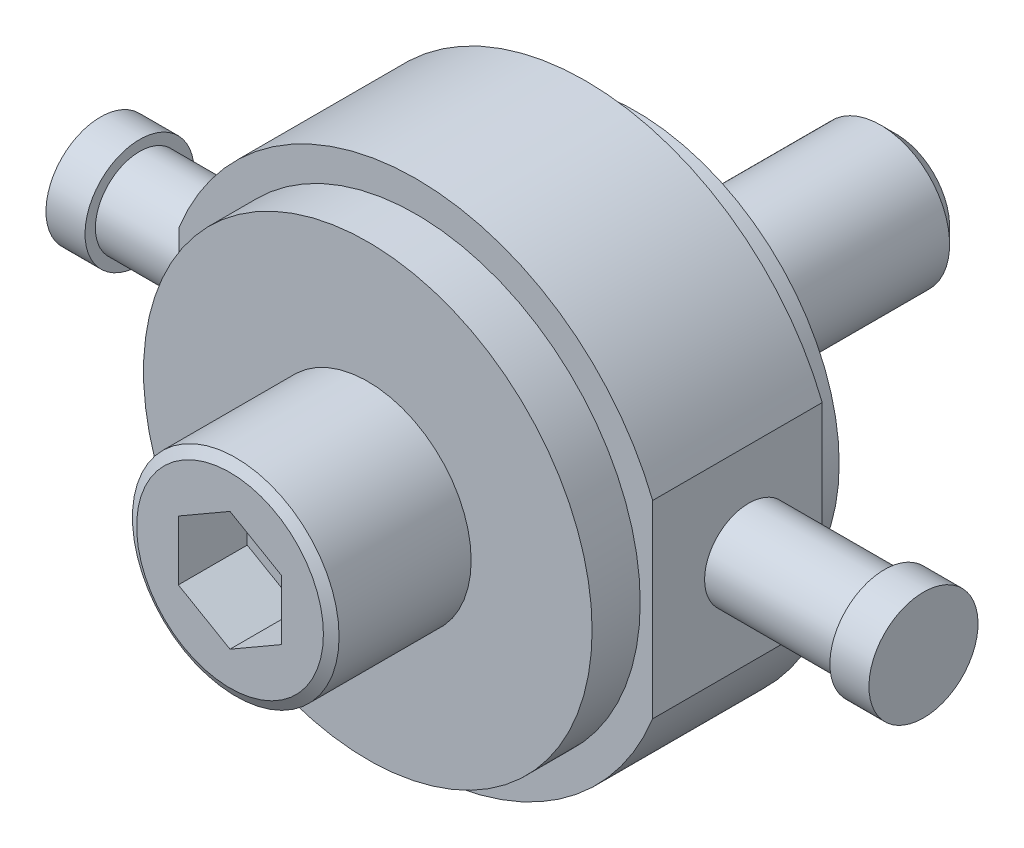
ISO-10303-21;
HEADER;
FILE_DESCRIPTION(('STEP AP214'),'2;1');
FILE_NAME('part.step','',(''),(''),'','','');
FILE_SCHEMA(('AUTOMOTIVE_DESIGN { 1 0 10303 214 1 1 1 1 }'));
ENDSEC;
DATA;
#1=APPLICATION_CONTEXT('core data for automotive mechanical design processes');
#2=APPLICATION_PROTOCOL_DEFINITION('international standard','automotive_design',2000,#1);
#3=PRODUCT_CONTEXT('',#1,'mechanical');
#4=PRODUCT('Part','Part','',(#3));
#5=PRODUCT_RELATED_PRODUCT_CATEGORY('part','',(#4));
#6=PRODUCT_DEFINITION_FORMATION('','',#4);
#7=PRODUCT_DEFINITION_CONTEXT('part definition',#1,'design');
#8=PRODUCT_DEFINITION('design','',#6,#7);
#9=PRODUCT_DEFINITION_SHAPE('','',#8);
#10=(LENGTH_UNIT() NAMED_UNIT(*) SI_UNIT(.MILLI.,.METRE.));
#11=(NAMED_UNIT(*) PLANE_ANGLE_UNIT() SI_UNIT($,.RADIAN.));
#12=(NAMED_UNIT(*) SI_UNIT($,.STERADIAN.) SOLID_ANGLE_UNIT());
#13=UNCERTAINTY_MEASURE_WITH_UNIT(LENGTH_MEASURE(1.E-05),#10,'distance_accuracy_value','');
#14=(GEOMETRIC_REPRESENTATION_CONTEXT(3) GLOBAL_UNCERTAINTY_ASSIGNED_CONTEXT((#13)) GLOBAL_UNIT_ASSIGNED_CONTEXT((#10,
#11,#12)) REPRESENTATION_CONTEXT('',''));
#15=CARTESIAN_POINT('',(0.,0.,0.));
#16=DIRECTION('',(0.,0.,1.));
#17=DIRECTION('',(1.,0.,0.));
#18=AXIS2_PLACEMENT_3D('',#15,#16,#17);
#19=CARTESIAN_POINT('',(0.,0.,0.));
#20=DIRECTION('',(0.,0.,1.));
#21=DIRECTION('',(1.,0.,0.));
#22=AXIS2_PLACEMENT_3D('',#19,#20,#21);
#23=PLANE('',#22);
#24=CARTESIAN_POINT('',(0.,0.,0.));
#25=DIRECTION('',(0.,0.,1.));
#26=DIRECTION('',(1.,0.,0.));
#27=AXIS2_PLACEMENT_3D('',#24,#25,#26);
#28=CIRCLE('',#27,53.15);
#29=CARTESIAN_POINT('',(53.15,0.,0.));
#30=VERTEX_POINT('',#29);
#31=EDGE_CURVE('E184',#30,#30,#28,.T.);
#32=ORIENTED_EDGE('',*,*,#31,.F.);
#33=EDGE_LOOP('',(#32));
#34=FACE_BOUND('',#33,.T.);
#35=CARTESIAN_POINT('',(0.,0.,0.));
#36=DIRECTION('',(0.,0.,-1.));
#37=DIRECTION('',(-1.,0.,0.));
#38=AXIS2_PLACEMENT_3D('',#35,#36,#37);
#39=CIRCLE('',#38,18.);
#40=CARTESIAN_POINT('',(-18.,0.,0.));
#41=VERTEX_POINT('',#40);
#42=EDGE_CURVE('E150',#41,#41,#39,.T.);
#43=ORIENTED_EDGE('',*,*,#42,.F.);
#44=EDGE_LOOP('',(#43));
#45=FACE_BOUND('',#44,.T.);
#46=ADVANCED_FACE('F14',(#34,#45),#23,.F.);
#47=CARTESIAN_POINT('',(97.3,0.,32.33));
#48=DIRECTION('',(-1.,0.,0.));
#49=DIRECTION('',(0.,-1.,0.));
#50=AXIS2_PLACEMENT_3D('',#47,#48,#49);
#51=PLANE('',#50);
#52=CARTESIAN_POINT('',(97.3,0.,32.33));
#53=DIRECTION('',(-1.,0.,0.));
#54=DIRECTION('',(0.,0.,1.));
#55=AXIS2_PLACEMENT_3D('',#52,#53,#54);
#56=CIRCLE('',#55,11.5325);
#57=CARTESIAN_POINT('',(97.3,0.,43.8625));
#58=VERTEX_POINT('',#57);
#59=EDGE_CURVE('E181',#58,#58,#56,.T.);
#60=ORIENTED_EDGE('',*,*,#59,.F.);
#61=EDGE_LOOP('',(#60));
#62=FACE_BOUND('',#61,.T.);
#63=CARTESIAN_POINT('',(97.3,0.,32.33));
#64=DIRECTION('',(-1.,0.,0.));
#65=DIRECTION('',(0.,-1.,0.));
#66=AXIS2_PLACEMENT_3D('',#63,#64,#65);
#67=CIRCLE('',#66,14.25);
#68=CARTESIAN_POINT('',(97.3,-14.25,32.33));
#69=VERTEX_POINT('',#68);
#70=EDGE_CURVE('E24',#69,#69,#67,.T.);
#71=ORIENTED_EDGE('',*,*,#70,.T.);
#72=EDGE_LOOP('',(#71));
#73=FACE_BOUND('',#72,.T.);
#74=ADVANCED_FACE('F241',(#62,#73),#51,.T.);
#75=CARTESIAN_POINT('',(-97.3,0.,32.33));
#76=DIRECTION('',(-1.,0.,0.));
#77=DIRECTION('',(0.,-1.,0.));
#78=AXIS2_PLACEMENT_3D('',#75,#76,#77);
#79=PLANE('',#78);
#80=CARTESIAN_POINT('',(-97.3,0.,32.33));
#81=DIRECTION('',(-1.,0.,0.));
#82=DIRECTION('',(0.,0.,1.));
#83=AXIS2_PLACEMENT_3D('',#80,#81,#82);
#84=CIRCLE('',#83,11.5325);
#85=CARTESIAN_POINT('',(-97.3,0.,43.8625));
#86=VERTEX_POINT('',#85);
#87=EDGE_CURVE('E173',#86,#86,#84,.F.);
#88=ORIENTED_EDGE('',*,*,#87,.F.);
#89=EDGE_LOOP('',(#88));
#90=FACE_BOUND('',#89,.T.);
#91=CARTESIAN_POINT('',(-97.3,0.,32.33));
#92=DIRECTION('',(-1.,0.,0.));
#93=DIRECTION('',(0.,-1.,0.));
#94=AXIS2_PLACEMENT_3D('',#91,#92,#93);
#95=CIRCLE('',#94,14.25);
#96=CARTESIAN_POINT('',(-97.3,-14.25,32.33));
#97=VERTEX_POINT('',#96);
#98=EDGE_CURVE('E155',#97,#97,#95,.T.);
#99=ORIENTED_EDGE('',*,*,#98,.F.);
#100=EDGE_LOOP('',(#99));
#101=FACE_BOUND('',#100,.T.);
#102=ADVANCED_FACE('F247',(#90,#101),#79,.F.);
#103=CARTESIAN_POINT('',(-103.85,0.,32.33));
#104=DIRECTION('',(1.,0.,0.));
#105=DIRECTION('',(0.,0.,-1.));
#106=AXIS2_PLACEMENT_3D('',#103,#104,#105);
#107=CYLINDRICAL_SURFACE('',#106,11.5325);
#108=CARTESIAN_POINT('',(-61.85,0.,32.33));
#109=DIRECTION('',(1.,0.,0.));
#110=DIRECTION('',(0.,0.,-1.));
#111=AXIS2_PLACEMENT_3D('',#108,#109,#110);
#112=CIRCLE('',#111,11.5325);
#113=CARTESIAN_POINT('',(-61.85,0.,20.7975));
#114=VERTEX_POINT('',#113);
#115=EDGE_CURVE('E174',#114,#114,#112,.T.);
#116=ORIENTED_EDGE('',*,*,#115,.F.);
#117=EDGE_LOOP('',(#116));
#118=FACE_BOUND('',#117,.T.);
#119=ORIENTED_EDGE('',*,*,#87,.T.);
#120=EDGE_LOOP('',(#119));
#121=FACE_BOUND('',#120,.T.);
#122=ADVANCED_FACE('F332',(#118,#121),#107,.T.);
#123=CARTESIAN_POINT('',(0.,0.,70.));
#124=DIRECTION('',(0.,0.,1.));
#125=DIRECTION('',(1.,0.,0.));
#126=AXIS2_PLACEMENT_3D('',#123,#124,#125);
#127=PLANE('',#126);
#128=CARTESIAN_POINT('',(0.,0.,70.));
#129=DIRECTION('',(0.,0.,1.));
#130=DIRECTION('',(1.,0.,0.));
#131=AXIS2_PLACEMENT_3D('',#128,#129,#130);
#132=CIRCLE('',#131,58.6);
#133=CARTESIAN_POINT('',(58.6,0.,70.));
#134=VERTEX_POINT('',#133);
#135=EDGE_CURVE('E169',#134,#134,#132,.T.);
#136=ORIENTED_EDGE('',*,*,#135,.T.);
#137=EDGE_LOOP('',(#136));
#138=FACE_BOUND('',#137,.T.);
#139=CARTESIAN_POINT('',(0.,0.,70.));
#140=DIRECTION('',(0.,0.,1.));
#141=DIRECTION('',(1.,0.,0.));
#142=AXIS2_PLACEMENT_3D('',#139,#140,#141);
#143=CIRCLE('',#142,27.);
#144=CARTESIAN_POINT('',(27.,0.,70.));
#145=VERTEX_POINT('',#144);
#146=EDGE_CURVE('E161',#145,#145,#143,.T.);
#147=ORIENTED_EDGE('',*,*,#146,.F.);
#148=EDGE_LOOP('',(#147));
#149=FACE_BOUND('',#148,.T.);
#150=ADVANCED_FACE('F291',(#138,#149),#127,.T.);
#151=CARTESIAN_POINT('',(0.,0.,57.43));
#152=DIRECTION('',(0.,0.,1.));
#153=DIRECTION('',(1.,0.,0.));
#154=AXIS2_PLACEMENT_3D('',#151,#152,#153);
#155=PLANE('',#154);
#156=CARTESIAN_POINT('',(0.,0.,57.43));
#157=DIRECTION('',(0.,0.,1.));
#158=DIRECTION('',(1.,0.,0.));
#159=AXIS2_PLACEMENT_3D('',#156,#157,#158);
#160=CIRCLE('',#159,66.6);
#161=CARTESIAN_POINT('',(-61.85,-24.7009615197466,57.43));
#162=VERTEX_POINT('',#161);
#163=CARTESIAN_POINT('',(61.85,-24.7009615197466,57.43));
#164=VERTEX_POINT('',#163);
#165=EDGE_CURVE('E172',#162,#164,#160,.T.);
#166=ORIENTED_EDGE('',*,*,#165,.T.);
#167=DIRECTION('',(0.,-1.,0.));
#168=VECTOR('',#167,1.);
#169=CARTESIAN_POINT('',(61.85,24.7009615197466,57.43));
#170=LINE('',#169,#168);
#171=CARTESIAN_POINT('',(61.85,24.7009615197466,57.43));
#172=VERTEX_POINT('',#171);
#173=EDGE_CURVE('E199',#172,#164,#170,.T.);
#174=ORIENTED_EDGE('',*,*,#173,.F.);
#175=CARTESIAN_POINT('',(0.,0.,57.43));
#176=DIRECTION('',(0.,0.,1.));
#177=DIRECTION('',(1.,0.,0.));
#178=AXIS2_PLACEMENT_3D('',#175,#176,#177);
#179=CIRCLE('',#178,66.6);
#180=CARTESIAN_POINT('',(-61.85,24.7009615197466,57.43));
#181=VERTEX_POINT('',#180);
#182=EDGE_CURVE('E200',#172,#181,#179,.T.);
#183=ORIENTED_EDGE('',*,*,#182,.T.);
#184=DIRECTION('',(0.,-1.,0.));
#185=VECTOR('',#184,1.);
#186=CARTESIAN_POINT('',(-61.85,24.7009615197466,57.43));
#187=LINE('',#186,#185);
#188=EDGE_CURVE('E196',#181,#162,#187,.T.);
#189=ORIENTED_EDGE('',*,*,#188,.T.);
#190=EDGE_LOOP('',(#166,#174,#183,#189));
#191=FACE_BOUND('',#190,.T.);
#192=CARTESIAN_POINT('',(0.,0.,57.43));
#193=DIRECTION('',(0.,0.,1.));
#194=DIRECTION('',(1.,0.,0.));
#195=AXIS2_PLACEMENT_3D('',#192,#193,#194);
#196=CIRCLE('',#195,58.6);
#197=CARTESIAN_POINT('',(58.6,0.,57.43));
#198=VERTEX_POINT('',#197);
#199=EDGE_CURVE('E165',#198,#198,#196,.T.);
#200=ORIENTED_EDGE('',*,*,#199,.F.);
#201=EDGE_LOOP('',(#200));
#202=FACE_BOUND('',#201,.T.);
#203=ADVANCED_FACE('F285',(#191,#202),#155,.T.);
#204=CARTESIAN_POINT('',(61.85,24.7009615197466,57.43));
#205=DIRECTION('',(1.,0.,0.));
#206=DIRECTION('',(0.,0.,-1.));
#207=AXIS2_PLACEMENT_3D('',#204,#205,#206);
#208=PLANE('',#207);
#209=DIRECTION('',(0.,0.,-1.));
#210=VECTOR('',#209,1.);
#211=CARTESIAN_POINT('',(61.85,24.7009615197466,57.43));
#212=LINE('',#211,#210);
#213=CARTESIAN_POINT('',(61.85,24.7009615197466,13.13));
#214=VERTEX_POINT('',#213);
#215=EDGE_CURVE('E187',#172,#214,#212,.T.);
#216=ORIENTED_EDGE('',*,*,#215,.F.);
#217=ORIENTED_EDGE('',*,*,#173,.T.);
#218=DIRECTION('',(0.,0.,-1.));
#219=VECTOR('',#218,1.);
#220=CARTESIAN_POINT('',(61.85,-24.7009615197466,57.43));
#221=LINE('',#220,#219);
#222=CARTESIAN_POINT('',(61.85,-24.7009615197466,13.13));
#223=VERTEX_POINT('',#222);
#224=EDGE_CURVE('E192',#164,#223,#221,.T.);
#225=ORIENTED_EDGE('',*,*,#224,.T.);
#226=DIRECTION('',(0.,-1.,0.));
#227=VECTOR('',#226,1.);
#228=CARTESIAN_POINT('',(61.85,24.7009615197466,13.13));
#229=LINE('',#228,#227);
#230=EDGE_CURVE('E188',#214,#223,#229,.T.);
#231=ORIENTED_EDGE('',*,*,#230,.F.);
#232=EDGE_LOOP('',(#216,#217,#225,#231));
#233=FACE_BOUND('',#232,.T.);
#234=CARTESIAN_POINT('',(61.85,0.,32.33));
#235=DIRECTION('',(1.,0.,0.));
#236=DIRECTION('',(0.,0.,-1.));
#237=AXIS2_PLACEMENT_3D('',#234,#235,#236);
#238=CIRCLE('',#237,11.5325);
#239=CARTESIAN_POINT('',(61.85,0.,20.7975));
#240=VERTEX_POINT('',#239);
#241=EDGE_CURVE('E168',#240,#240,#238,.T.);
#242=ORIENTED_EDGE('',*,*,#241,.F.);
#243=EDGE_LOOP('',(#242));
#244=FACE_BOUND('',#243,.T.);
#245=ADVANCED_FACE('F254',(#233,#244),#208,.T.);
#246=CARTESIAN_POINT('',(0.,0.,13.13));
#247=DIRECTION('',(0.,0.,1.));
#248=DIRECTION('',(1.,0.,0.));
#249=AXIS2_PLACEMENT_3D('',#246,#247,#248);
#250=PLANE('',#249);
#251=CARTESIAN_POINT('',(0.,0.,13.13));
#252=DIRECTION('',(0.,0.,1.));
#253=DIRECTION('',(1.,0.,0.));
#254=AXIS2_PLACEMENT_3D('',#251,#252,#253);
#255=CIRCLE('',#254,66.6);
#256=CARTESIAN_POINT('',(-61.85,-24.7009615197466,13.13));
#257=VERTEX_POINT('',#256);
#258=EDGE_CURVE('E193',#257,#223,#255,.T.);
#259=ORIENTED_EDGE('',*,*,#258,.F.);
#260=DIRECTION('',(0.,-1.,0.));
#261=VECTOR('',#260,1.);
#262=CARTESIAN_POINT('',(-61.85,24.7009615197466,13.13));
#263=LINE('',#262,#261);
#264=CARTESIAN_POINT('',(-61.85,24.7009615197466,13.13));
#265=VERTEX_POINT('',#264);
#266=EDGE_CURVE('E182',#265,#257,#263,.T.);
#267=ORIENTED_EDGE('',*,*,#266,.F.);
#268=CARTESIAN_POINT('',(0.,0.,13.13));
#269=DIRECTION('',(0.,0.,1.));
#270=DIRECTION('',(1.,0.,0.));
#271=AXIS2_PLACEMENT_3D('',#268,#269,#270);
#272=CIRCLE('',#271,66.6);
#273=EDGE_CURVE('E178',#214,#265,#272,.T.);
#274=ORIENTED_EDGE('',*,*,#273,.F.);
#275=ORIENTED_EDGE('',*,*,#230,.T.);
#276=EDGE_LOOP('',(#259,#267,#274,#275));
#277=FACE_BOUND('',#276,.T.);
#278=CARTESIAN_POINT('',(0.,0.,13.13));
#279=DIRECTION('',(0.,0.,1.));
#280=DIRECTION('',(1.,0.,0.));
#281=AXIS2_PLACEMENT_3D('',#278,#279,#280);
#282=CIRCLE('',#281,53.15);
#283=CARTESIAN_POINT('',(53.15,0.,13.13));
#284=VERTEX_POINT('',#283);
#285=EDGE_CURVE('E191',#284,#284,#282,.T.);
#286=ORIENTED_EDGE('',*,*,#285,.T.);
#287=EDGE_LOOP('',(#286));
#288=FACE_BOUND('',#287,.T.);
#289=ADVANCED_FACE('F274',(#277,#288),#250,.F.);
#290=CARTESIAN_POINT('',(0.,0.,57.43));
#291=DIRECTION('',(0.,0.,-1.));
#292=DIRECTION('',(-1.,0.,0.));
#293=AXIS2_PLACEMENT_3D('',#290,#291,#292);
#294=CYLINDRICAL_SURFACE('',#293,66.6);
#295=ORIENTED_EDGE('',*,*,#224,.F.);
#296=ORIENTED_EDGE('',*,*,#165,.F.);
#297=DIRECTION('',(0.,0.,-1.));
#298=VECTOR('',#297,1.);
#299=CARTESIAN_POINT('',(-61.85,-24.7009615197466,57.43));
#300=LINE('',#299,#298);
#301=EDGE_CURVE('E88',#162,#257,#300,.T.);
#302=ORIENTED_EDGE('',*,*,#301,.T.);
#303=ORIENTED_EDGE('',*,*,#258,.T.);
#304=EDGE_LOOP('',(#295,#296,#302,#303));
#305=FACE_BOUND('',#304,.T.);
#306=ADVANCED_FACE('F276',(#305),#294,.T.);
#307=CARTESIAN_POINT('',(0.,0.,57.43));
#308=DIRECTION('',(0.,0.,-1.));
#309=DIRECTION('',(-1.,0.,0.));
#310=AXIS2_PLACEMENT_3D('',#307,#308,#309);
#311=CYLINDRICAL_SURFACE('',#310,66.6);
#312=DIRECTION('',(0.,0.,-1.));
#313=VECTOR('',#312,1.);
#314=CARTESIAN_POINT('',(-61.85,24.7009615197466,57.43));
#315=LINE('',#314,#313);
#316=EDGE_CURVE('E177',#181,#265,#315,.T.);
#317=ORIENTED_EDGE('',*,*,#316,.F.);
#318=ORIENTED_EDGE('',*,*,#182,.F.);
#319=ORIENTED_EDGE('',*,*,#215,.T.);
#320=ORIENTED_EDGE('',*,*,#273,.T.);
#321=EDGE_LOOP('',(#317,#318,#319,#320));
#322=FACE_BOUND('',#321,.T.);
#323=ADVANCED_FACE('F268',(#322),#311,.T.);
#324=CARTESIAN_POINT('',(-61.85,24.7009615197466,57.43));
#325=DIRECTION('',(1.,0.,0.));
#326=DIRECTION('',(0.,0.,-1.));
#327=AXIS2_PLACEMENT_3D('',#324,#325,#326);
#328=PLANE('',#327);
#329=ORIENTED_EDGE('',*,*,#115,.T.);
#330=EDGE_LOOP('',(#329));
#331=FACE_BOUND('',#330,.T.);
#332=ORIENTED_EDGE('',*,*,#188,.F.);
#333=ORIENTED_EDGE('',*,*,#316,.T.);
#334=ORIENTED_EDGE('',*,*,#266,.T.);
#335=ORIENTED_EDGE('',*,*,#301,.F.);
#336=EDGE_LOOP('',(#332,#333,#334,#335));
#337=FACE_BOUND('',#336,.T.);
#338=ADVANCED_FACE('F259',(#331,#337),#328,.F.);
#339=CARTESIAN_POINT('',(0.,0.,13.13));
#340=DIRECTION('',(0.,0.,-1.));
#341=DIRECTION('',(-1.,0.,0.));
#342=AXIS2_PLACEMENT_3D('',#339,#340,#341);
#343=CYLINDRICAL_SURFACE('',#342,53.15);
#344=ORIENTED_EDGE('',*,*,#285,.F.);
#345=EDGE_LOOP('',(#344));
#346=FACE_BOUND('',#345,.T.);
#347=ORIENTED_EDGE('',*,*,#31,.T.);
#348=EDGE_LOOP('',(#347));
#349=FACE_BOUND('',#348,.T.);
#350=ADVANCED_FACE('F256',(#346,#349),#343,.T.);
#351=CARTESIAN_POINT('',(103.85,0.,32.33));
#352=DIRECTION('',(-1.,0.,0.));
#353=DIRECTION('',(0.,0.,1.));
#354=AXIS2_PLACEMENT_3D('',#351,#352,#353);
#355=CYLINDRICAL_SURFACE('',#354,11.5325);
#356=ORIENTED_EDGE('',*,*,#59,.T.);
#357=EDGE_LOOP('',(#356));
#358=FACE_BOUND('',#357,.T.);
#359=ORIENTED_EDGE('',*,*,#241,.T.);
#360=EDGE_LOOP('',(#359));
#361=FACE_BOUND('',#360,.T.);
#362=ADVANCED_FACE('F258',(#358,#361),#355,.T.);
#363=CARTESIAN_POINT('',(0.,0.,70.));
#364=DIRECTION('',(0.,0.,-1.));
#365=DIRECTION('',(-1.,0.,0.));
#366=AXIS2_PLACEMENT_3D('',#363,#364,#365);
#367=CYLINDRICAL_SURFACE('',#366,58.6);
#368=ORIENTED_EDGE('',*,*,#135,.F.);
#369=EDGE_LOOP('',(#368));
#370=FACE_BOUND('',#369,.T.);
#371=ORIENTED_EDGE('',*,*,#199,.T.);
#372=EDGE_LOOP('',(#371));
#373=FACE_BOUND('',#372,.T.);
#374=ADVANCED_FACE('F265',(#370,#373),#367,.T.);
#375=CARTESIAN_POINT('',(0.,0.,106.));
#376=DIRECTION('',(0.,0.,-1.));
#377=DIRECTION('',(-1.,0.,0.));
#378=AXIS2_PLACEMENT_3D('',#375,#376,#377);
#379=CYLINDRICAL_SURFACE('',#378,27.);
#380=CARTESIAN_POINT('',(0.,0.,104.5));
#381=DIRECTION('',(0.,0.,1.));
#382=DIRECTION('',(1.,0.,0.));
#383=AXIS2_PLACEMENT_3D('',#380,#381,#382);
#384=CIRCLE('',#383,27.);
#385=CARTESIAN_POINT('',(27.,0.,104.5));
#386=VERTEX_POINT('',#385);
#387=EDGE_CURVE('E18',#386,#386,#384,.F.);
#388=ORIENTED_EDGE('',*,*,#387,.T.);
#389=EDGE_LOOP('',(#388));
#390=FACE_BOUND('',#389,.T.);
#391=ORIENTED_EDGE('',*,*,#146,.T.);
#392=EDGE_LOOP('',(#391));
#393=FACE_BOUND('',#392,.T.);
#394=ADVANCED_FACE('F309',(#390,#393),#379,.T.);
#395=CARTESIAN_POINT('',(0.,0.,106.));
#396=DIRECTION('',(0.,0.,1.));
#397=DIRECTION('',(1.,0.,0.));
#398=AXIS2_PLACEMENT_3D('',#395,#396,#397);
#399=PLANE('',#398);
#400=DIRECTION('',(-0.866025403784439,0.5,0.));
#401=VECTOR('',#400,1.);
#402=CARTESIAN_POINT('',(13.5,7.79422863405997,106.));
#403=LINE('',#402,#401);
#404=CARTESIAN_POINT('',(13.5,7.79422863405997,106.));
#405=VERTEX_POINT('',#404);
#406=CARTESIAN_POINT('',(0.,15.5884572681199,106.));
#407=VERTEX_POINT('',#406);
#408=EDGE_CURVE('E94',#405,#407,#403,.T.);
#409=ORIENTED_EDGE('',*,*,#408,.F.);
#410=DIRECTION('',(0.,1.,0.));
#411=VECTOR('',#410,1.);
#412=CARTESIAN_POINT('',(13.5,-7.79422863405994,106.));
#413=LINE('',#412,#411);
#414=CARTESIAN_POINT('',(13.5,-7.79422863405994,106.));
#415=VERTEX_POINT('',#414);
#416=EDGE_CURVE('E142',#415,#405,#413,.T.);
#417=ORIENTED_EDGE('',*,*,#416,.F.);
#418=DIRECTION('',(0.866025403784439,0.5,0.));
#419=VECTOR('',#418,1.);
#420=CARTESIAN_POINT('',(0.,-15.5884572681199,106.));
#421=LINE('',#420,#419);
#422=CARTESIAN_POINT('',(0.,-15.5884572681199,106.));
#423=VERTEX_POINT('',#422);
#424=EDGE_CURVE('E138',#423,#415,#421,.T.);
#425=ORIENTED_EDGE('',*,*,#424,.F.);
#426=DIRECTION('',(0.866025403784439,-0.5,0.));
#427=VECTOR('',#426,1.);
#428=CARTESIAN_POINT('',(-13.5,-7.79422863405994,106.));
#429=LINE('',#428,#427);
#430=CARTESIAN_POINT('',(-13.5,-7.79422863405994,106.));
#431=VERTEX_POINT('',#430);
#432=EDGE_CURVE('E134',#431,#423,#429,.T.);
#433=ORIENTED_EDGE('',*,*,#432,.F.);
#434=DIRECTION('',(0.,-1.,0.));
#435=VECTOR('',#434,1.);
#436=CARTESIAN_POINT('',(-13.5,7.79422863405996,106.));
#437=LINE('',#436,#435);
#438=CARTESIAN_POINT('',(-13.5,7.79422863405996,106.));
#439=VERTEX_POINT('',#438);
#440=EDGE_CURVE('E130',#439,#431,#437,.T.);
#441=ORIENTED_EDGE('',*,*,#440,.F.);
#442=DIRECTION('',(-0.866025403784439,-0.5,0.));
#443=VECTOR('',#442,1.);
#444=CARTESIAN_POINT('',(0.,15.5884572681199,106.));
#445=LINE('',#444,#443);
#446=EDGE_CURVE('E103',#407,#439,#445,.T.);
#447=ORIENTED_EDGE('',*,*,#446,.F.);
#448=EDGE_LOOP('',(#409,#417,#425,#433,#441,#447));
#449=FACE_BOUND('',#448,.T.);
#450=CARTESIAN_POINT('',(0.,0.,106.));
#451=DIRECTION('',(0.,0.,1.));
#452=DIRECTION('',(1.,0.,0.));
#453=AXIS2_PLACEMENT_3D('',#450,#451,#452);
#454=CIRCLE('',#453,24.4019237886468);
#455=CARTESIAN_POINT('',(24.4019237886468,0.,106.));
#456=VERTEX_POINT('',#455);
#457=EDGE_CURVE('E164',#456,#456,#454,.T.);
#458=ORIENTED_EDGE('',*,*,#457,.T.);
#459=EDGE_LOOP('',(#458));
#460=FACE_BOUND('',#459,.T.);
#461=ADVANCED_FACE('F225',(#449,#460),#399,.T.);
#462=CARTESIAN_POINT('',(0.,0.,-63.5));
#463=DIRECTION('',(0.,0.,1.));
#464=DIRECTION('',(1.,0.,0.));
#465=AXIS2_PLACEMENT_3D('',#462,#463,#464);
#466=CYLINDRICAL_SURFACE('',#465,18.);
#467=CARTESIAN_POINT('',(0.,0.,-64.));
#468=DIRECTION('',(0.,0.,-1.));
#469=DIRECTION('',(-1.,0.,0.));
#470=AXIS2_PLACEMENT_3D('',#467,#468,#469);
#471=CIRCLE('',#470,18.);
#472=CARTESIAN_POINT('',(-18.,0.,-64.));
#473=VERTEX_POINT('',#472);
#474=EDGE_CURVE('E153',#473,#473,#471,.F.);
#475=ORIENTED_EDGE('',*,*,#474,.T.);
#476=EDGE_LOOP('',(#475));
#477=FACE_BOUND('',#476,.T.);
#478=ORIENTED_EDGE('',*,*,#42,.T.);
#479=EDGE_LOOP('',(#478));
#480=FACE_BOUND('',#479,.T.);
#481=ADVANCED_FACE('F317',(#477,#480),#466,.T.);
#482=CARTESIAN_POINT('',(0.,0.,-68.));
#483=DIRECTION('',(0.,0.,-1.));
#484=DIRECTION('',(-1.,0.,0.));
#485=AXIS2_PLACEMENT_3D('',#482,#483,#484);
#486=PLANE('',#485);
#487=CARTESIAN_POINT('',(0.,0.,-68.));
#488=DIRECTION('',(0.,0.,-1.));
#489=DIRECTION('',(-1.,0.,0.));
#490=AXIS2_PLACEMENT_3D('',#487,#488,#489);
#491=CIRCLE('',#490,14.);
#492=CARTESIAN_POINT('',(-14.,0.,-68.));
#493=VERTEX_POINT('',#492);
#494=EDGE_CURVE('E128',#493,#493,#491,.T.);
#495=ORIENTED_EDGE('',*,*,#494,.T.);
#496=EDGE_LOOP('',(#495));
#497=FACE_BOUND('',#496,.T.);
#498=ADVANCED_FACE('F237',(#497),#486,.T.);
#499=CARTESIAN_POINT('',(0.,0.,-68.));
#500=DIRECTION('',(0.,0.,1.));
#501=DIRECTION('',(1.,0.,0.));
#502=AXIS2_PLACEMENT_3D('',#499,#500,#501);
#503=CONICAL_SURFACE('',#502,14.,0.785398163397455);
#504=ORIENTED_EDGE('',*,*,#474,.F.);
#505=EDGE_LOOP('',(#504));
#506=FACE_BOUND('',#505,.T.);
#507=ORIENTED_EDGE('',*,*,#494,.F.);
#508=EDGE_LOOP('',(#507));
#509=FACE_BOUND('',#508,.T.);
#510=ADVANCED_FACE('F228',(#506,#509),#503,.T.);
#511=CARTESIAN_POINT('',(0.,0.,106.));
#512=DIRECTION('',(0.,0.,-1.));
#513=DIRECTION('',(-1.,0.,0.));
#514=AXIS2_PLACEMENT_3D('',#511,#512,#513);
#515=CONICAL_SURFACE('',#514,24.4019237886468,1.04719755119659);
#516=ORIENTED_EDGE('',*,*,#387,.F.);
#517=EDGE_LOOP('',(#516));
#518=FACE_BOUND('',#517,.T.);
#519=ORIENTED_EDGE('',*,*,#457,.F.);
#520=EDGE_LOOP('',(#519));
#521=FACE_BOUND('',#520,.T.);
#522=ADVANCED_FACE('F16',(#518,#521),#515,.T.);
#523=CARTESIAN_POINT('',(13.5,7.79422863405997,88.));
#524=DIRECTION('',(0.5,0.866025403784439,0.));
#525=DIRECTION('',(-0.866025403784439,0.5,0.));
#526=AXIS2_PLACEMENT_3D('',#523,#524,#525);
#527=PLANE('',#526);
#528=ORIENTED_EDGE('',*,*,#408,.T.);
#529=DIRECTION('',(0.,0.,1.));
#530=VECTOR('',#529,1.);
#531=CARTESIAN_POINT('',(0.,15.5884572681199,88.));
#532=LINE('',#531,#530);
#533=CARTESIAN_POINT('',(0.,15.5884572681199,88.));
#534=VERTEX_POINT('',#533);
#535=EDGE_CURVE('E97',#534,#407,#532,.T.);
#536=ORIENTED_EDGE('',*,*,#535,.F.);
#537=DIRECTION('',(-0.866025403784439,0.5,0.));
#538=VECTOR('',#537,1.);
#539=CARTESIAN_POINT('',(13.5,7.79422863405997,88.));
#540=LINE('',#539,#538);
#541=CARTESIAN_POINT('',(13.5,7.79422863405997,88.));
#542=VERTEX_POINT('',#541);
#543=EDGE_CURVE('E100',#542,#534,#540,.T.);
#544=ORIENTED_EDGE('',*,*,#543,.F.);
#545=DIRECTION('',(0.,0.,1.));
#546=VECTOR('',#545,1.);
#547=CARTESIAN_POINT('',(13.5,7.79422863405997,88.));
#548=LINE('',#547,#546);
#549=EDGE_CURVE('E127',#542,#405,#548,.T.);
#550=ORIENTED_EDGE('',*,*,#549,.T.);
#551=EDGE_LOOP('',(#528,#536,#544,#550));
#552=FACE_BOUND('',#551,.T.);
#553=ADVANCED_FACE('F98',(#552),#527,.F.);
#554=CARTESIAN_POINT('',(13.5,-7.79422863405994,88.));
#555=DIRECTION('',(1.,0.,0.));
#556=DIRECTION('',(0.,0.,-1.));
#557=AXIS2_PLACEMENT_3D('',#554,#555,#556);
#558=PLANE('',#557);
#559=ORIENTED_EDGE('',*,*,#416,.T.);
#560=ORIENTED_EDGE('',*,*,#549,.F.);
#561=DIRECTION('',(0.,1.,0.));
#562=VECTOR('',#561,1.);
#563=CARTESIAN_POINT('',(13.5,-7.79422863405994,88.));
#564=LINE('',#563,#562);
#565=CARTESIAN_POINT('',(13.5,-7.79422863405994,88.));
#566=VERTEX_POINT('',#565);
#567=EDGE_CURVE('E115',#566,#542,#564,.T.);
#568=ORIENTED_EDGE('',*,*,#567,.F.);
#569=DIRECTION('',(0.,0.,1.));
#570=VECTOR('',#569,1.);
#571=CARTESIAN_POINT('',(13.5,-7.79422863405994,88.));
#572=LINE('',#571,#570);
#573=EDGE_CURVE('E141',#566,#415,#572,.T.);
#574=ORIENTED_EDGE('',*,*,#573,.T.);
#575=EDGE_LOOP('',(#559,#560,#568,#574));
#576=FACE_BOUND('',#575,.T.);
#577=ADVANCED_FACE('F235',(#576),#558,.F.);
#578=CARTESIAN_POINT('',(0.,-15.5884572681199,88.));
#579=DIRECTION('',(0.5,-0.866025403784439,0.));
#580=DIRECTION('',(0.866025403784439,0.5,0.));
#581=AXIS2_PLACEMENT_3D('',#578,#579,#580);
#582=PLANE('',#581);
#583=ORIENTED_EDGE('',*,*,#424,.T.);
#584=ORIENTED_EDGE('',*,*,#573,.F.);
#585=DIRECTION('',(0.866025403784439,0.5,0.));
#586=VECTOR('',#585,1.);
#587=CARTESIAN_POINT('',(0.,-15.5884572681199,88.));
#588=LINE('',#587,#586);
#589=CARTESIAN_POINT('',(0.,-15.5884572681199,88.));
#590=VERTEX_POINT('',#589);
#591=EDGE_CURVE('E122',#590,#566,#588,.T.);
#592=ORIENTED_EDGE('',*,*,#591,.F.);
#593=DIRECTION('',(0.,0.,1.));
#594=VECTOR('',#593,1.);
#595=CARTESIAN_POINT('',(0.,-15.5884572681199,88.));
#596=LINE('',#595,#594);
#597=EDGE_CURVE('E137',#590,#423,#596,.T.);
#598=ORIENTED_EDGE('',*,*,#597,.T.);
#599=EDGE_LOOP('',(#583,#584,#592,#598));
#600=FACE_BOUND('',#599,.T.);
#601=ADVANCED_FACE('F385',(#600),#582,.F.);
#602=CARTESIAN_POINT('',(-13.5,-7.79422863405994,88.));
#603=DIRECTION('',(-0.5,-0.866025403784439,0.));
#604=DIRECTION('',(0.866025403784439,-0.5,0.));
#605=AXIS2_PLACEMENT_3D('',#602,#603,#604);
#606=PLANE('',#605);
#607=ORIENTED_EDGE('',*,*,#432,.T.);
#608=ORIENTED_EDGE('',*,*,#597,.F.);
#609=DIRECTION('',(0.866025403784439,-0.5,0.));
#610=VECTOR('',#609,1.);
#611=CARTESIAN_POINT('',(-13.5,-7.79422863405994,88.));
#612=LINE('',#611,#610);
#613=CARTESIAN_POINT('',(-13.5,-7.79422863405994,88.));
#614=VERTEX_POINT('',#613);
#615=EDGE_CURVE('E119',#614,#590,#612,.T.);
#616=ORIENTED_EDGE('',*,*,#615,.F.);
#617=DIRECTION('',(0.,0.,1.));
#618=VECTOR('',#617,1.);
#619=CARTESIAN_POINT('',(-13.5,-7.79422863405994,88.));
#620=LINE('',#619,#618);
#621=EDGE_CURVE('E133',#614,#431,#620,.T.);
#622=ORIENTED_EDGE('',*,*,#621,.T.);
#623=EDGE_LOOP('',(#607,#608,#616,#622));
#624=FACE_BOUND('',#623,.T.);
#625=ADVANCED_FACE('F381',(#624),#606,.F.);
#626=CARTESIAN_POINT('',(-13.5,7.79422863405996,88.));
#627=DIRECTION('',(-1.,0.,0.));
#628=DIRECTION('',(0.,-1.,0.));
#629=AXIS2_PLACEMENT_3D('',#626,#627,#628);
#630=PLANE('',#629);
#631=ORIENTED_EDGE('',*,*,#440,.T.);
#632=ORIENTED_EDGE('',*,*,#621,.F.);
#633=DIRECTION('',(0.,-1.,0.));
#634=VECTOR('',#633,1.);
#635=CARTESIAN_POINT('',(-13.5,7.79422863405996,88.));
#636=LINE('',#635,#634);
#637=CARTESIAN_POINT('',(-13.5,7.79422863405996,88.));
#638=VERTEX_POINT('',#637);
#639=EDGE_CURVE('E110',#638,#614,#636,.T.);
#640=ORIENTED_EDGE('',*,*,#639,.F.);
#641=DIRECTION('',(0.,0.,1.));
#642=VECTOR('',#641,1.);
#643=CARTESIAN_POINT('',(-13.5,7.79422863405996,88.));
#644=LINE('',#643,#642);
#645=EDGE_CURVE('E33',#638,#439,#644,.T.);
#646=ORIENTED_EDGE('',*,*,#645,.T.);
#647=EDGE_LOOP('',(#631,#632,#640,#646));
#648=FACE_BOUND('',#647,.T.);
#649=ADVANCED_FACE('F378',(#648),#630,.F.);
#650=CARTESIAN_POINT('',(0.,15.5884572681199,88.));
#651=DIRECTION('',(-0.5,0.866025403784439,0.));
#652=DIRECTION('',(-0.866025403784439,-0.5,0.));
#653=AXIS2_PLACEMENT_3D('',#650,#651,#652);
#654=PLANE('',#653);
#655=ORIENTED_EDGE('',*,*,#446,.T.);
#656=ORIENTED_EDGE('',*,*,#645,.F.);
#657=DIRECTION('',(-0.866025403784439,-0.5,0.));
#658=VECTOR('',#657,1.);
#659=CARTESIAN_POINT('',(0.,15.5884572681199,88.));
#660=LINE('',#659,#658);
#661=EDGE_CURVE('E106',#534,#638,#660,.T.);
#662=ORIENTED_EDGE('',*,*,#661,.F.);
#663=ORIENTED_EDGE('',*,*,#535,.T.);
#664=EDGE_LOOP('',(#655,#656,#662,#663));
#665=FACE_BOUND('',#664,.T.);
#666=ADVANCED_FACE('F107',(#665),#654,.F.);
#667=CARTESIAN_POINT('',(0.,15.5884572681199,88.));
#668=DIRECTION('',(0.,0.,1.));
#669=DIRECTION('',(1.,0.,0.));
#670=AXIS2_PLACEMENT_3D('',#667,#668,#669);
#671=PLANE('',#670);
#672=ORIENTED_EDGE('',*,*,#543,.T.);
#673=ORIENTED_EDGE('',*,*,#661,.T.);
#674=ORIENTED_EDGE('',*,*,#639,.T.);
#675=ORIENTED_EDGE('',*,*,#615,.T.);
#676=ORIENTED_EDGE('',*,*,#591,.T.);
#677=ORIENTED_EDGE('',*,*,#567,.T.);
#678=EDGE_LOOP('',(#672,#673,#674,#675,#676,#677));
#679=FACE_BOUND('',#678,.T.);
#680=ADVANCED_FACE('F112',(#679),#671,.T.);
#681=CARTESIAN_POINT('',(-107.5,0.,32.33));
#682=DIRECTION('',(-1.,0.,0.));
#683=DIRECTION('',(0.,-1.,0.));
#684=AXIS2_PLACEMENT_3D('',#681,#682,#683);
#685=PLANE('',#684);
#686=CARTESIAN_POINT('',(-107.5,0.,32.33));
#687=DIRECTION('',(-1.,0.,0.));
#688=DIRECTION('',(0.,-1.,0.));
#689=AXIS2_PLACEMENT_3D('',#686,#687,#688);
#690=CIRCLE('',#689,14.25);
#691=CARTESIAN_POINT('',(-107.5,-14.25,32.33));
#692=VERTEX_POINT('',#691);
#693=EDGE_CURVE('E125',#692,#692,#690,.T.);
#694=ORIENTED_EDGE('',*,*,#693,.T.);
#695=EDGE_LOOP('',(#694));
#696=FACE_BOUND('',#695,.T.);
#697=ADVANCED_FACE('F354',(#696),#685,.T.);
#698=CARTESIAN_POINT('',(-107.5,0.,32.33));
#699=DIRECTION('',(1.,0.,0.));
#700=DIRECTION('',(0.,1.,0.));
#701=AXIS2_PLACEMENT_3D('',#698,#699,#700);
#702=CYLINDRICAL_SURFACE('',#701,14.25);
#703=ORIENTED_EDGE('',*,*,#693,.F.);
#704=EDGE_LOOP('',(#703));
#705=FACE_BOUND('',#704,.T.);
#706=ORIENTED_EDGE('',*,*,#98,.T.);
#707=EDGE_LOOP('',(#706));
#708=FACE_BOUND('',#707,.T.);
#709=ADVANCED_FACE('F329',(#705,#708),#702,.T.);
#710=CARTESIAN_POINT('',(107.5,0.,32.33));
#711=DIRECTION('',(-1.,0.,0.));
#712=DIRECTION('',(0.,-1.,0.));
#713=AXIS2_PLACEMENT_3D('',#710,#711,#712);
#714=PLANE('',#713);
#715=CARTESIAN_POINT('',(107.5,0.,32.33));
#716=DIRECTION('',(-1.,0.,0.));
#717=DIRECTION('',(0.,-1.,0.));
#718=AXIS2_PLACEMENT_3D('',#715,#716,#717);
#719=CIRCLE('',#718,14.25);
#720=CARTESIAN_POINT('',(107.5,-14.25,32.33));
#721=VERTEX_POINT('',#720);
#722=EDGE_CURVE('E9',#721,#721,#719,.T.);
#723=ORIENTED_EDGE('',*,*,#722,.F.);
#724=EDGE_LOOP('',(#723));
#725=FACE_BOUND('',#724,.T.);
#726=ADVANCED_FACE('F353',(#725),#714,.F.);
#727=CARTESIAN_POINT('',(107.5,0.,32.33));
#728=DIRECTION('',(-1.,0.,0.));
#729=DIRECTION('',(0.,-1.,0.));
#730=AXIS2_PLACEMENT_3D('',#727,#728,#729);
#731=CYLINDRICAL_SURFACE('',#730,14.25);
#732=ORIENTED_EDGE('',*,*,#722,.T.);
#733=EDGE_LOOP('',(#732));
#734=FACE_BOUND('',#733,.T.);
#735=ORIENTED_EDGE('',*,*,#70,.F.);
#736=EDGE_LOOP('',(#735));
#737=FACE_BOUND('',#736,.T.);
#738=ADVANCED_FACE('F360',(#734,#737),#731,.T.);
#739=CLOSED_SHELL('',(#46,#74,#102,#122,#150,#203,#245,#289,#306,#323,#338,#350,#362,#374,#394,
#461,#481,#498,#510,#522,#553,#577,#601,#625,#649,#666,#680,#697,#709,#726,#738));
#740=MANIFOLD_SOLID_BREP('B1',#739);
#741=ADVANCED_BREP_SHAPE_REPRESENTATION('',(#18,#740),#14);
#742=SHAPE_DEFINITION_REPRESENTATION(#9,#741);
ENDSEC;
END-ISO-10303-21;
